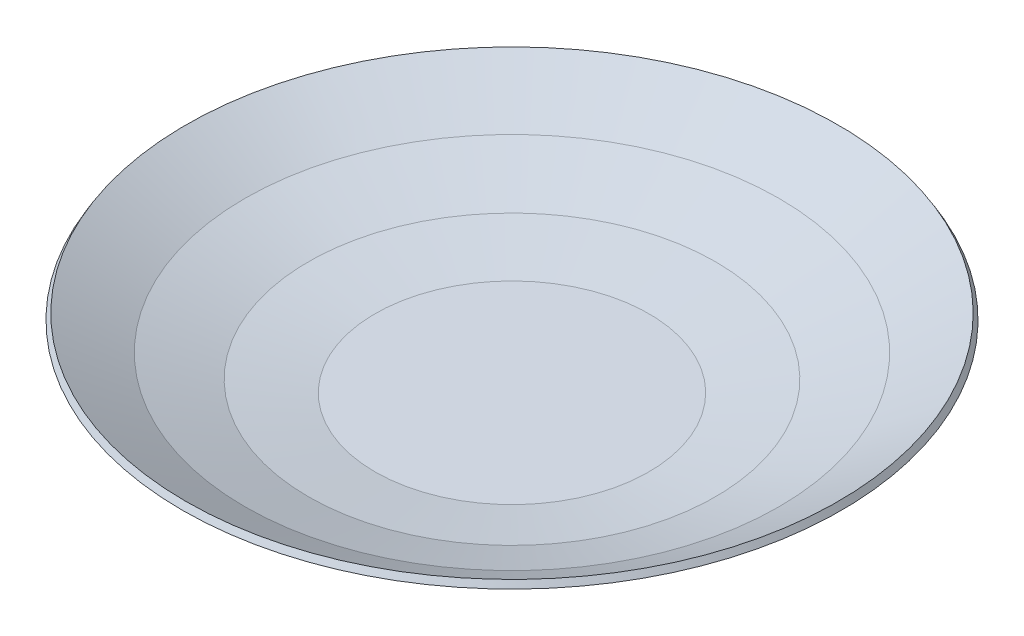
from build123d import *


with BuildPart() as part:
    # Sketch2 → Revolve1 (revolve)
    with BuildSketch(Plane.XY, mode=Mode.PRIVATE) as revolve1_sk:
        with BuildLine():
            Line((0, 1), (0, 0))
            Line((0, 0), (19.912511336, 0))
            ThreePointArc((19.912511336, 0), (19.999667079, 0.003805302), (20.086159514, 0.015192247))
            Line((20.086159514, 0.015192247), (29.761918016, 1.72128953))
            ThreePointArc((29.761918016, 1.72128953), (29.847088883, 1.740171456), (29.930289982, 1.766404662))
            Line((29.930289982, 1.766404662), (39.162791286, 5.126760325))
            ThreePointArc((39.162791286, 5.126760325), (39.243389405, 5.160145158), (39.320771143, 5.200427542))
            Line((39.320771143, 5.200427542), (47.905257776, 10.15668321))
            Line((47.905257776, 10.15668321), (47.405257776, 11.022708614))
            Line((47.405257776, 11.022708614), (38.820771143, 6.066452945))
            Line((38.820771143, 6.066452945), (29.588269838, 2.706097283))
            Line((29.588269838, 2.706097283), (19.912511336, 1))
            Line((19.912511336, 1), (0, 1))
        make_face()
    revolve(revolve1_sk.sketch.rotate(Axis((0, 1, 0), (0, -1, 0)), 90), axis=Axis((0, 1, 0), (0, -1, 0)))


solid = part.part
